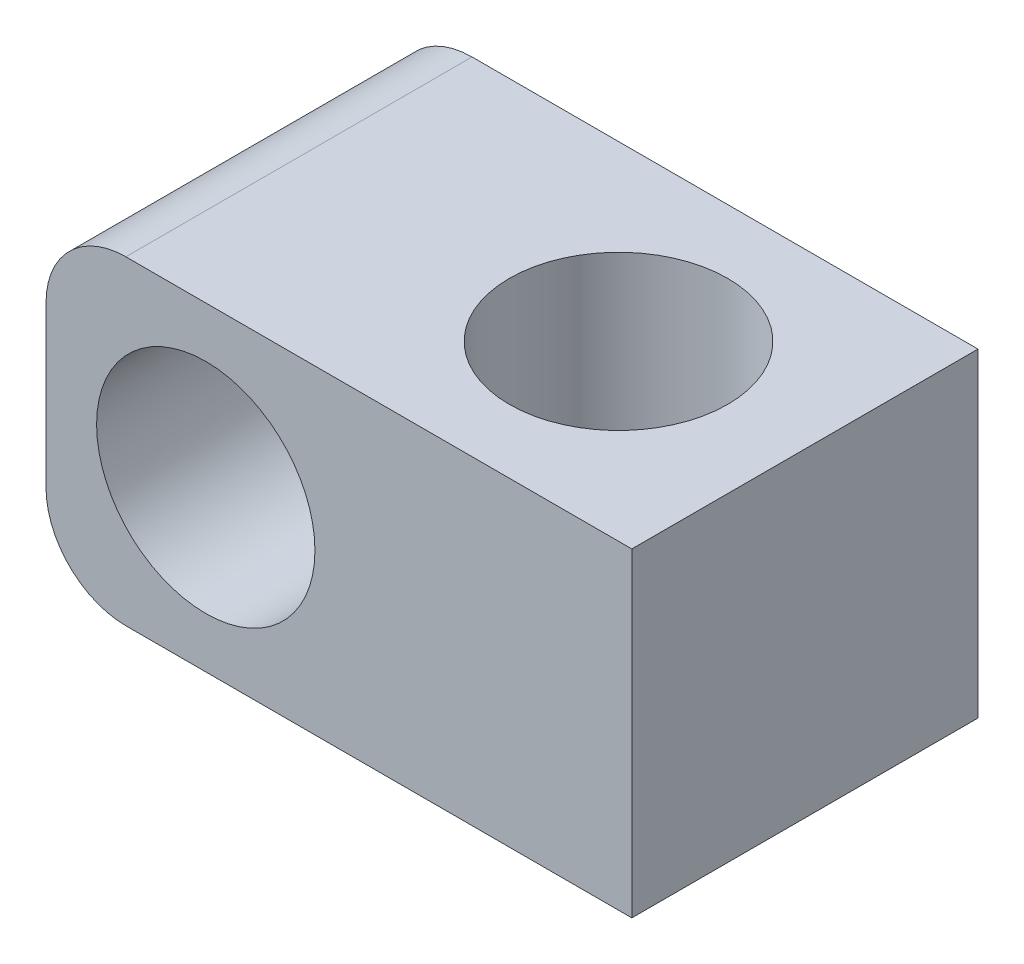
ISO-10303-21;
HEADER;
FILE_DESCRIPTION(('STEP AP214'),'2;1');
FILE_NAME('part.step','',(''),(''),'','','');
FILE_SCHEMA(('AUTOMOTIVE_DESIGN { 1 0 10303 214 1 1 1 1 }'));
ENDSEC;
DATA;
#1=APPLICATION_CONTEXT('core data for automotive mechanical design processes');
#2=APPLICATION_PROTOCOL_DEFINITION('international standard','automotive_design',2000,#1);
#3=PRODUCT_CONTEXT('',#1,'mechanical');
#4=PRODUCT('Part','Part','',(#3));
#5=PRODUCT_RELATED_PRODUCT_CATEGORY('part','',(#4));
#6=PRODUCT_DEFINITION_FORMATION('','',#4);
#7=PRODUCT_DEFINITION_CONTEXT('part definition',#1,'design');
#8=PRODUCT_DEFINITION('design','',#6,#7);
#9=PRODUCT_DEFINITION_SHAPE('','',#8);
#10=(LENGTH_UNIT() NAMED_UNIT(*) SI_UNIT(.MILLI.,.METRE.));
#11=(NAMED_UNIT(*) PLANE_ANGLE_UNIT() SI_UNIT($,.RADIAN.));
#12=(NAMED_UNIT(*) SI_UNIT($,.STERADIAN.) SOLID_ANGLE_UNIT());
#13=UNCERTAINTY_MEASURE_WITH_UNIT(LENGTH_MEASURE(1.E-05),#10,'distance_accuracy_value','');
#14=(GEOMETRIC_REPRESENTATION_CONTEXT(3) GLOBAL_UNCERTAINTY_ASSIGNED_CONTEXT((#13)) GLOBAL_UNIT_ASSIGNED_CONTEXT((#10,
#11,#12)) REPRESENTATION_CONTEXT('',''));
#15=CARTESIAN_POINT('',(0.,0.,0.));
#16=DIRECTION('',(0.,0.,1.));
#17=DIRECTION('',(1.,0.,0.));
#18=AXIS2_PLACEMENT_3D('',#15,#16,#17);
#19=CARTESIAN_POINT('',(-6.,-6.,-6.5));
#20=DIRECTION('',(0.,-1.,0.));
#21=DIRECTION('',(0.,0.,-1.));
#22=AXIS2_PLACEMENT_3D('',#19,#20,#21);
#23=PLANE('',#22);
#24=CARTESIAN_POINT('',(9.,-6.,0.));
#25=DIRECTION('',(0.,-1.,0.));
#26=DIRECTION('',(0.,0.,-1.));
#27=AXIS2_PLACEMENT_3D('',#24,#25,#26);
#28=CIRCLE('',#27,4.1);
#29=CARTESIAN_POINT('',(9.,-6.,-4.1));
#30=VERTEX_POINT('',#29);
#31=EDGE_CURVE('E187',#30,#30,#28,.F.);
#32=ORIENTED_EDGE('',*,*,#31,.T.);
#33=EDGE_LOOP('',(#32));
#34=FACE_BOUND('',#33,.T.);
#35=DIRECTION('',(1.,0.,0.));
#36=VECTOR('',#35,1.);
#37=CARTESIAN_POINT('',(-6.,-6.,6.5));
#38=LINE('',#37,#36);
#39=CARTESIAN_POINT('',(-3.,-6.,6.5));
#40=VERTEX_POINT('',#39);
#41=CARTESIAN_POINT('',(16.,-6.,6.5));
#42=VERTEX_POINT('',#41);
#43=EDGE_CURVE('E85',#40,#42,#38,.T.);
#44=ORIENTED_EDGE('',*,*,#43,.F.);
#45=DIRECTION('',(0.,0.,1.));
#46=VECTOR('',#45,1.);
#47=CARTESIAN_POINT('',(-3.,-6.,-6.5));
#48=LINE('',#47,#46);
#49=CARTESIAN_POINT('',(-3.,-6.,-6.5));
#50=VERTEX_POINT('',#49);
#51=EDGE_CURVE('E11',#40,#50,#48,.F.);
#52=ORIENTED_EDGE('',*,*,#51,.T.);
#53=DIRECTION('',(1.,0.,0.));
#54=VECTOR('',#53,1.);
#55=CARTESIAN_POINT('',(-6.,-6.,-6.5));
#56=LINE('',#55,#54);
#57=CARTESIAN_POINT('',(16.,-6.,-6.5));
#58=VERTEX_POINT('',#57);
#59=EDGE_CURVE('E99',#50,#58,#56,.T.);
#60=ORIENTED_EDGE('',*,*,#59,.T.);
#61=DIRECTION('',(0.,0.,1.));
#62=VECTOR('',#61,1.);
#63=CARTESIAN_POINT('',(16.,-6.,-6.5));
#64=LINE('',#63,#62);
#65=EDGE_CURVE('E98',#58,#42,#64,.T.);
#66=ORIENTED_EDGE('',*,*,#65,.T.);
#67=EDGE_LOOP('',(#44,#52,#60,#66));
#68=FACE_BOUND('',#67,.T.);
#69=ADVANCED_FACE('F33',(#34,#68),#23,.T.);
#70=CARTESIAN_POINT('',(-6.,6.,-6.5));
#71=DIRECTION('',(-1.,0.,0.));
#72=DIRECTION('',(0.,-1.,0.));
#73=AXIS2_PLACEMENT_3D('',#70,#71,#72);
#74=PLANE('',#73);
#75=DIRECTION('',(0.,-1.,0.));
#76=VECTOR('',#75,1.);
#77=CARTESIAN_POINT('',(-6.,6.,6.5));
#78=LINE('',#77,#76);
#79=CARTESIAN_POINT('',(-6.,3.,6.5));
#80=VERTEX_POINT('',#79);
#81=CARTESIAN_POINT('',(-6.,-3.,6.5));
#82=VERTEX_POINT('',#81);
#83=EDGE_CURVE('E109',#80,#82,#78,.T.);
#84=ORIENTED_EDGE('',*,*,#83,.F.);
#85=DIRECTION('',(0.,0.,1.));
#86=VECTOR('',#85,1.);
#87=CARTESIAN_POINT('',(-6.,3.,-6.5));
#88=LINE('',#87,#86);
#89=CARTESIAN_POINT('',(-6.,3.,-6.5));
#90=VERTEX_POINT('',#89);
#91=EDGE_CURVE('E134',#80,#90,#88,.F.);
#92=ORIENTED_EDGE('',*,*,#91,.T.);
#93=DIRECTION('',(0.,-1.,0.));
#94=VECTOR('',#93,1.);
#95=CARTESIAN_POINT('',(-6.,6.,-6.5));
#96=LINE('',#95,#94);
#97=CARTESIAN_POINT('',(-6.,-3.,-6.5));
#98=VERTEX_POINT('',#97);
#99=EDGE_CURVE('E104',#90,#98,#96,.T.);
#100=ORIENTED_EDGE('',*,*,#99,.T.);
#101=DIRECTION('',(0.,0.,1.));
#102=VECTOR('',#101,1.);
#103=CARTESIAN_POINT('',(-6.,-3.,-6.5));
#104=LINE('',#103,#102);
#105=EDGE_CURVE('E131',#98,#82,#104,.T.);
#106=ORIENTED_EDGE('',*,*,#105,.T.);
#107=EDGE_LOOP('',(#84,#92,#100,#106));
#108=FACE_BOUND('',#107,.T.);
#109=ADVANCED_FACE('F147',(#108),#74,.T.);
#110=CARTESIAN_POINT('',(-6.,6.,-6.5));
#111=DIRECTION('',(0.,1.,0.));
#112=DIRECTION('',(0.,0.,1.));
#113=AXIS2_PLACEMENT_3D('',#110,#111,#112);
#114=PLANE('',#113);
#115=CARTESIAN_POINT('',(9.,6.,0.));
#116=DIRECTION('',(0.,1.,0.));
#117=DIRECTION('',(0.,0.,1.));
#118=AXIS2_PLACEMENT_3D('',#115,#116,#117);
#119=CIRCLE('',#118,4.1);
#120=CARTESIAN_POINT('',(9.,6.,4.1));
#121=VERTEX_POINT('',#120);
#122=EDGE_CURVE('E185',#121,#121,#119,.T.);
#123=ORIENTED_EDGE('',*,*,#122,.F.);
#124=EDGE_LOOP('',(#123));
#125=FACE_BOUND('',#124,.T.);
#126=DIRECTION('',(-1.,0.,0.));
#127=VECTOR('',#126,1.);
#128=CARTESIAN_POINT('',(-6.,6.,-6.5));
#129=LINE('',#128,#127);
#130=CARTESIAN_POINT('',(16.,6.,-6.5));
#131=VERTEX_POINT('',#130);
#132=CARTESIAN_POINT('',(-3.,6.,-6.5));
#133=VERTEX_POINT('',#132);
#134=EDGE_CURVE('E120',#131,#133,#129,.T.);
#135=ORIENTED_EDGE('',*,*,#134,.T.);
#136=DIRECTION('',(0.,0.,1.));
#137=VECTOR('',#136,1.);
#138=CARTESIAN_POINT('',(-3.,6.,-6.5));
#139=LINE('',#138,#137);
#140=CARTESIAN_POINT('',(-3.,6.,6.5));
#141=VERTEX_POINT('',#140);
#142=EDGE_CURVE('E124',#133,#141,#139,.T.);
#143=ORIENTED_EDGE('',*,*,#142,.T.);
#144=DIRECTION('',(-1.,0.,0.));
#145=VECTOR('',#144,1.);
#146=CARTESIAN_POINT('',(-6.,6.,6.5));
#147=LINE('',#146,#145);
#148=CARTESIAN_POINT('',(16.,6.,6.5));
#149=VERTEX_POINT('',#148);
#150=EDGE_CURVE('E107',#149,#141,#147,.T.);
#151=ORIENTED_EDGE('',*,*,#150,.F.);
#152=DIRECTION('',(0.,0.,1.));
#153=VECTOR('',#152,1.);
#154=CARTESIAN_POINT('',(16.,6.,-6.5));
#155=LINE('',#154,#153);
#156=EDGE_CURVE('E103',#131,#149,#155,.T.);
#157=ORIENTED_EDGE('',*,*,#156,.F.);
#158=EDGE_LOOP('',(#135,#143,#151,#157));
#159=FACE_BOUND('',#158,.T.);
#160=ADVANCED_FACE('F143',(#125,#159),#114,.T.);
#161=CARTESIAN_POINT('',(16.,6.,-6.5));
#162=DIRECTION('',(1.,0.,0.));
#163=DIRECTION('',(0.,0.,-1.));
#164=AXIS2_PLACEMENT_3D('',#161,#162,#163);
#165=PLANE('',#164);
#166=ORIENTED_EDGE('',*,*,#156,.T.);
#167=DIRECTION('',(0.,1.,0.));
#168=VECTOR('',#167,1.);
#169=CARTESIAN_POINT('',(16.,6.,6.5));
#170=LINE('',#169,#168);
#171=EDGE_CURVE('E91',#42,#149,#170,.T.);
#172=ORIENTED_EDGE('',*,*,#171,.F.);
#173=ORIENTED_EDGE('',*,*,#65,.F.);
#174=DIRECTION('',(0.,1.,0.));
#175=VECTOR('',#174,1.);
#176=CARTESIAN_POINT('',(16.,6.,-6.5));
#177=LINE('',#176,#175);
#178=EDGE_CURVE('E118',#58,#131,#177,.T.);
#179=ORIENTED_EDGE('',*,*,#178,.T.);
#180=EDGE_LOOP('',(#166,#172,#173,#179));
#181=FACE_BOUND('',#180,.T.);
#182=ADVANCED_FACE('F106',(#181),#165,.T.);
#183=CARTESIAN_POINT('',(0.,0.,-6.5));
#184=DIRECTION('',(0.,0.,-1.));
#185=DIRECTION('',(-1.,0.,0.));
#186=AXIS2_PLACEMENT_3D('',#183,#184,#185);
#187=PLANE('',#186);
#188=CARTESIAN_POINT('',(0.,0.,-6.5));
#189=DIRECTION('',(0.,0.,1.));
#190=DIRECTION('',(1.,0.,0.));
#191=AXIS2_PLACEMENT_3D('',#188,#189,#190);
#192=CIRCLE('',#191,4.1);
#193=CARTESIAN_POINT('',(4.1,0.,-6.5));
#194=VERTEX_POINT('',#193);
#195=EDGE_CURVE('E114',#194,#194,#192,.T.);
#196=ORIENTED_EDGE('',*,*,#195,.T.);
#197=EDGE_LOOP('',(#196));
#198=FACE_BOUND('',#197,.T.);
#199=ORIENTED_EDGE('',*,*,#99,.F.);
#200=CARTESIAN_POINT('',(-3.,3.,-6.5));
#201=DIRECTION('',(0.,0.,-1.));
#202=DIRECTION('',(-1.,0.,0.));
#203=AXIS2_PLACEMENT_3D('',#200,#201,#202);
#204=CIRCLE('',#203,3.);
#205=EDGE_CURVE('E41',#90,#133,#204,.T.);
#206=ORIENTED_EDGE('',*,*,#205,.T.);
#207=ORIENTED_EDGE('',*,*,#134,.F.);
#208=ORIENTED_EDGE('',*,*,#178,.F.);
#209=ORIENTED_EDGE('',*,*,#59,.F.);
#210=CARTESIAN_POINT('',(-3.,-3.,-6.5));
#211=DIRECTION('',(0.,0.,-1.));
#212=DIRECTION('',(-1.,0.,0.));
#213=AXIS2_PLACEMENT_3D('',#210,#211,#212);
#214=CIRCLE('',#213,3.);
#215=EDGE_CURVE('E53',#50,#98,#214,.T.);
#216=ORIENTED_EDGE('',*,*,#215,.T.);
#217=EDGE_LOOP('',(#199,#206,#207,#208,#209,#216));
#218=FACE_BOUND('',#217,.T.);
#219=ADVANCED_FACE('F138',(#198,#218),#187,.T.);
#220=CARTESIAN_POINT('',(0.,0.,-6.5));
#221=DIRECTION('',(0.,0.,1.));
#222=DIRECTION('',(1.,0.,0.));
#223=AXIS2_PLACEMENT_3D('',#220,#221,#222);
#224=CYLINDRICAL_SURFACE('',#223,4.1);
#225=CARTESIAN_POINT('',(0.,0.,6.5));
#226=DIRECTION('',(0.,0.,1.));
#227=DIRECTION('',(1.,0.,0.));
#228=AXIS2_PLACEMENT_3D('',#225,#226,#227);
#229=CIRCLE('',#228,4.1);
#230=CARTESIAN_POINT('',(4.1,0.,6.5));
#231=VERTEX_POINT('',#230);
#232=EDGE_CURVE('E95',#231,#231,#229,.T.);
#233=CARTESIAN_POINT('',(4.1,0.,-6.5));
#234=CARTESIAN_POINT('',(4.1,0.,-6.36458333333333));
#235=CARTESIAN_POINT('',(4.1,0.,-6.22916666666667));
#236=CARTESIAN_POINT('',(4.1,0.,-5.95833333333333));
#237=CARTESIAN_POINT('',(4.1,0.,-5.82291666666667));
#238=CARTESIAN_POINT('',(4.1,0.,-5.55208333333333));
#239=CARTESIAN_POINT('',(4.1,0.,-5.41666666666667));
#240=CARTESIAN_POINT('',(4.1,0.,-5.14583333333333));
#241=CARTESIAN_POINT('',(4.1,0.,-5.01041666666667));
#242=CARTESIAN_POINT('',(4.1,0.,-4.73958333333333));
#243=CARTESIAN_POINT('',(4.1,0.,-4.60416666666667));
#244=CARTESIAN_POINT('',(4.1,0.,-4.33333333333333));
#245=CARTESIAN_POINT('',(4.1,0.,-4.19791666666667));
#246=CARTESIAN_POINT('',(4.1,0.,-3.92708333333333));
#247=CARTESIAN_POINT('',(4.1,0.,-3.79166666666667));
#248=CARTESIAN_POINT('',(4.1,0.,-3.52083333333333));
#249=CARTESIAN_POINT('',(4.1,0.,-3.38541666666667));
#250=CARTESIAN_POINT('',(4.1,0.,-3.11458333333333));
#251=CARTESIAN_POINT('',(4.1,0.,-2.97916666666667));
#252=CARTESIAN_POINT('',(4.1,0.,-2.70833333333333));
#253=CARTESIAN_POINT('',(4.1,0.,-2.57291666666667));
#254=CARTESIAN_POINT('',(4.1,0.,-2.30208333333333));
#255=CARTESIAN_POINT('',(4.1,0.,-2.16666666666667));
#256=CARTESIAN_POINT('',(4.1,0.,-1.89583333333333));
#257=CARTESIAN_POINT('',(4.1,0.,-1.76041666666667));
#258=CARTESIAN_POINT('',(4.1,0.,-1.48958333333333));
#259=CARTESIAN_POINT('',(4.1,0.,-1.35416666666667));
#260=CARTESIAN_POINT('',(4.1,0.,-1.08333333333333));
#261=CARTESIAN_POINT('',(4.1,0.,-0.947916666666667));
#262=CARTESIAN_POINT('',(4.1,0.,-0.677083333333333));
#263=CARTESIAN_POINT('',(4.1,0.,-0.541666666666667));
#264=CARTESIAN_POINT('',(4.1,0.,-0.270833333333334));
#265=CARTESIAN_POINT('',(4.1,0.,-0.135416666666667));
#266=CARTESIAN_POINT('',(4.1,0.,0.135416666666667));
#267=CARTESIAN_POINT('',(4.1,0.,0.270833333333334));
#268=CARTESIAN_POINT('',(4.1,0.,0.541666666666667));
#269=CARTESIAN_POINT('',(4.1,0.,0.677083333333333));
#270=CARTESIAN_POINT('',(4.1,0.,0.947916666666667));
#271=CARTESIAN_POINT('',(4.1,0.,1.08333333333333));
#272=CARTESIAN_POINT('',(4.1,0.,1.35416666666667));
#273=CARTESIAN_POINT('',(4.1,0.,1.48958333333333));
#274=CARTESIAN_POINT('',(4.1,0.,1.76041666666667));
#275=CARTESIAN_POINT('',(4.1,0.,1.89583333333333));
#276=CARTESIAN_POINT('',(4.1,0.,2.16666666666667));
#277=CARTESIAN_POINT('',(4.1,0.,2.30208333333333));
#278=CARTESIAN_POINT('',(4.1,0.,2.57291666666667));
#279=CARTESIAN_POINT('',(4.1,0.,2.70833333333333));
#280=CARTESIAN_POINT('',(4.1,0.,2.97916666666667));
#281=CARTESIAN_POINT('',(4.1,0.,3.11458333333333));
#282=CARTESIAN_POINT('',(4.1,0.,3.38541666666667));
#283=CARTESIAN_POINT('',(4.1,0.,3.52083333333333));
#284=CARTESIAN_POINT('',(4.1,0.,3.79166666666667));
#285=CARTESIAN_POINT('',(4.1,0.,3.92708333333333));
#286=CARTESIAN_POINT('',(4.1,0.,4.19791666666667));
#287=CARTESIAN_POINT('',(4.1,0.,4.33333333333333));
#288=CARTESIAN_POINT('',(4.1,0.,4.60416666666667));
#289=CARTESIAN_POINT('',(4.1,0.,4.73958333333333));
#290=CARTESIAN_POINT('',(4.1,0.,5.01041666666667));
#291=CARTESIAN_POINT('',(4.1,0.,5.14583333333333));
#292=CARTESIAN_POINT('',(4.1,0.,5.41666666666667));
#293=CARTESIAN_POINT('',(4.1,0.,5.55208333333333));
#294=CARTESIAN_POINT('',(4.1,0.,5.82291666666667));
#295=CARTESIAN_POINT('',(4.1,0.,5.95833333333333));
#296=CARTESIAN_POINT('',(4.1,0.,6.22916666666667));
#297=CARTESIAN_POINT('',(4.1,0.,6.36458333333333));
#298=CARTESIAN_POINT('',(4.1,0.,6.5));
#299=B_SPLINE_CURVE_WITH_KNOTS('',3,(#233,#234,#235,#236,#237,#238,#239,#240,#241,#242,#243,
#244,#245,#246,#247,#248,#249,#250,#251,#252,#253,#254,#255,#256,#257,#258,#259,#260,#261,#262,
#263,#264,#265,#266,#267,#268,#269,#270,#271,#272,#273,#274,#275,#276,#277,#278,#279,#280,#281,
#282,#283,#284,#285,#286,#287,#288,#289,#290,#291,#292,#293,#294,#295,#296,#297,#298),
.UNSPECIFIED.,.F.,.F.,(4,2,2,2,2,2,2,2,2,2,2,2,2,2,2,2,2,2,2,2,2,2,2,2,2,2,2,2,2,2,2,2,4),(0.,
0.40625,0.8125,1.21875,1.625,2.03125,2.4375,2.84375,3.25,3.65625,4.0625,4.46875,4.875,5.28125,
5.6875,6.09375,6.5,6.90625,7.3125,7.71875,8.125,8.53125,8.9375,9.34375,9.75,10.15625,10.5625,
10.96875,11.375,11.78125,12.1875,12.59375,13.),.UNSPECIFIED.);
#300=EDGE_CURVE('BSEAM171',#194,#231,#299,.T.);
#301=ORIENTED_EDGE('',*,*,#195,.F.);
#302=ORIENTED_EDGE('',*,*,#232,.T.);
#303=ORIENTED_EDGE('',*,*,#300,.T.);
#304=ORIENTED_EDGE('',*,*,#300,.F.);
#305=EDGE_LOOP('',(#301,#303,#302,#304));
#306=FACE_BOUND('',#305,.T.);
#307=ADVANCED_FACE('F171',(#306),#224,.F.);
#308=CARTESIAN_POINT('',(0.,0.,6.5));
#309=DIRECTION('',(0.,0.,-1.));
#310=DIRECTION('',(-1.,0.,0.));
#311=AXIS2_PLACEMENT_3D('',#308,#309,#310);
#312=PLANE('',#311);
#313=ORIENTED_EDGE('',*,*,#150,.T.);
#314=CARTESIAN_POINT('',(-3.,3.,6.5));
#315=DIRECTION('',(0.,0.,-1.));
#316=DIRECTION('',(-1.,0.,0.));
#317=AXIS2_PLACEMENT_3D('',#314,#315,#316);
#318=CIRCLE('',#317,3.);
#319=EDGE_CURVE('E129',#141,#80,#318,.F.);
#320=ORIENTED_EDGE('',*,*,#319,.T.);
#321=ORIENTED_EDGE('',*,*,#83,.T.);
#322=CARTESIAN_POINT('',(-3.,-3.,6.5));
#323=DIRECTION('',(0.,0.,-1.));
#324=DIRECTION('',(-1.,0.,0.));
#325=AXIS2_PLACEMENT_3D('',#322,#323,#324);
#326=CIRCLE('',#325,3.);
#327=EDGE_CURVE('E94',#82,#40,#326,.F.);
#328=ORIENTED_EDGE('',*,*,#327,.T.);
#329=ORIENTED_EDGE('',*,*,#43,.T.);
#330=ORIENTED_EDGE('',*,*,#171,.T.);
#331=EDGE_LOOP('',(#313,#320,#321,#328,#329,#330));
#332=FACE_BOUND('',#331,.T.);
#333=ORIENTED_EDGE('',*,*,#232,.F.);
#334=EDGE_LOOP('',(#333));
#335=FACE_BOUND('',#334,.T.);
#336=ADVANCED_FACE('F88',(#332,#335),#312,.F.);
#337=CARTESIAN_POINT('',(9.,-17.5965512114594,0.));
#338=DIRECTION('',(0.,1.,0.));
#339=DIRECTION('',(0.,0.,1.));
#340=AXIS2_PLACEMENT_3D('',#337,#338,#339);
#341=CYLINDRICAL_SURFACE('',#340,4.1);
#342=ORIENTED_EDGE('',*,*,#122,.T.);
#343=EDGE_LOOP('',(#342));
#344=FACE_BOUND('',#343,.T.);
#345=ORIENTED_EDGE('',*,*,#31,.F.);
#346=EDGE_LOOP('',(#345));
#347=FACE_BOUND('',#346,.T.);
#348=ADVANCED_FACE('F154',(#344,#347),#341,.F.);
#349=CARTESIAN_POINT('',(-3.,3.,-6.5));
#350=DIRECTION('',(0.,0.,1.));
#351=DIRECTION('',(1.,0.,0.));
#352=AXIS2_PLACEMENT_3D('',#349,#350,#351);
#353=CYLINDRICAL_SURFACE('',#352,3.);
#354=ORIENTED_EDGE('',*,*,#205,.F.);
#355=ORIENTED_EDGE('',*,*,#91,.F.);
#356=ORIENTED_EDGE('',*,*,#319,.F.);
#357=ORIENTED_EDGE('',*,*,#142,.F.);
#358=EDGE_LOOP('',(#354,#355,#356,#357));
#359=FACE_BOUND('',#358,.T.);
#360=ADVANCED_FACE('F144',(#359),#353,.T.);
#361=CARTESIAN_POINT('',(-3.,-3.,-6.5));
#362=DIRECTION('',(0.,0.,1.));
#363=DIRECTION('',(1.,0.,0.));
#364=AXIS2_PLACEMENT_3D('',#361,#362,#363);
#365=CYLINDRICAL_SURFACE('',#364,3.);
#366=ORIENTED_EDGE('',*,*,#215,.F.);
#367=ORIENTED_EDGE('',*,*,#51,.F.);
#368=ORIENTED_EDGE('',*,*,#327,.F.);
#369=ORIENTED_EDGE('',*,*,#105,.F.);
#370=EDGE_LOOP('',(#366,#367,#368,#369));
#371=FACE_BOUND('',#370,.T.);
#372=ADVANCED_FACE('F35',(#371),#365,.T.);
#373=CLOSED_SHELL('',(#69,#109,#160,#182,#219,#307,#336,#348,#360,#372));
#374=MANIFOLD_SOLID_BREP('B2',#373);
#375=ADVANCED_BREP_SHAPE_REPRESENTATION('',(#18,#374),#14);
#376=SHAPE_DEFINITION_REPRESENTATION(#9,#375);
ENDSEC;
END-ISO-10303-21;
